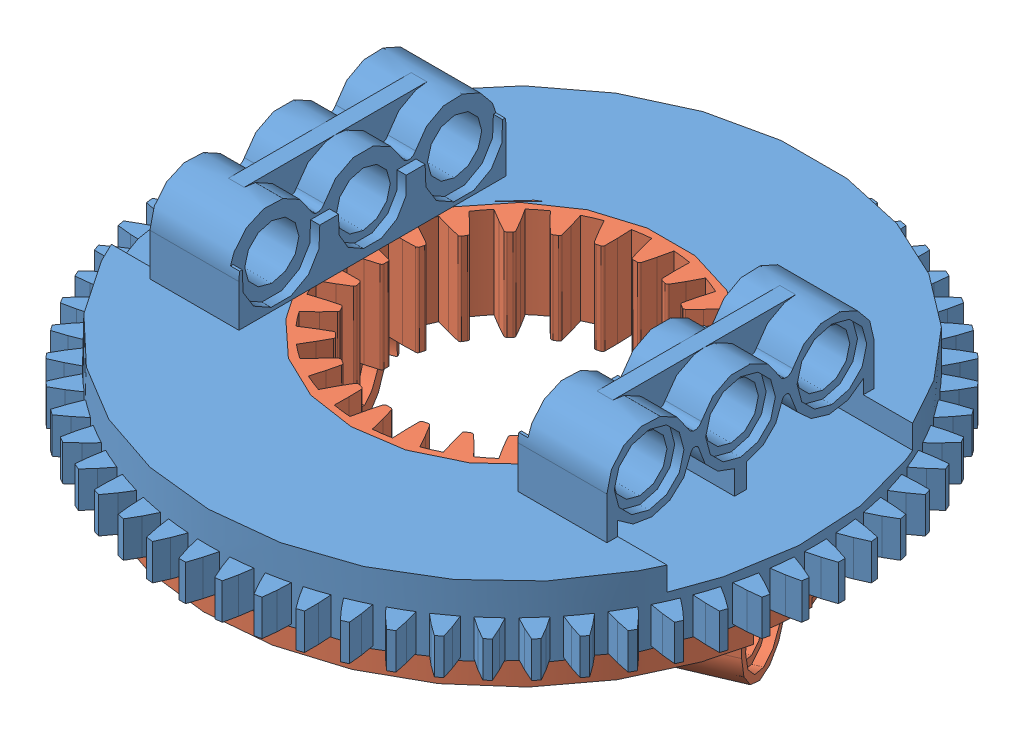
SolidWorks assembly turntable.SLDASM, configuration Default (file format 3100). Lengths in mm.
Overall size (70.35 22.95 70.35).
2 component instances, 2 part files, 2 mates.
Components (placement in the parent):
- turntable_female-1: turntable_female.SLDPRT [Default] at (-0.4969 -0.4462 0.5653) size (58.2 13.64 58.2)
- turntable_male-1: turntable_male.SLDPRT [Default] at (-0.4969 0.1788 0.5653) x (0.919498 0 -0.393094) z (-0.393094 0 -0.919498) size (53.6 15.51 53.6)
Mates (geometry in assembly coordinates):
- Concentric1: concentric anti-aligned: cylinder of turntable_female-1; cylinder of turntable_male-1
- Coincident1: coincident aligned: plane of turntable_female-1 through (-25.9895 5.7538 28.4563) normal (0 1 0); plane of turntable_male-1 through (-20.3041 5.7538 -7.3734) normal (0 1 0)
